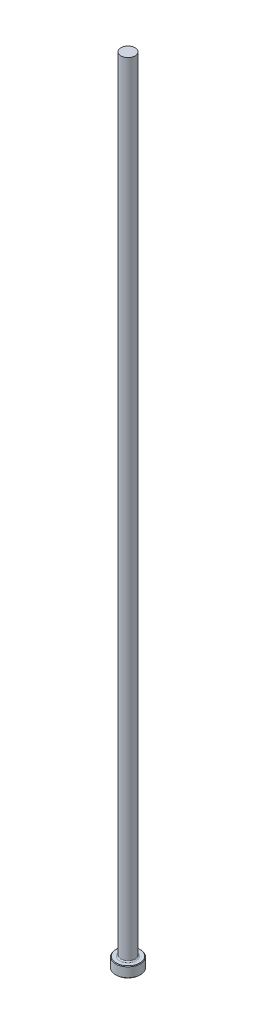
ISO-10303-21;
HEADER;
FILE_DESCRIPTION(('STEP AP214'),'2;1');
FILE_NAME('part.step','',(''),(''),'','','');
FILE_SCHEMA(('AUTOMOTIVE_DESIGN { 1 0 10303 214 1 1 1 1 }'));
ENDSEC;
DATA;
#1=APPLICATION_CONTEXT('core data for automotive mechanical design processes');
#2=APPLICATION_PROTOCOL_DEFINITION('international standard','automotive_design',2000,#1);
#3=PRODUCT_CONTEXT('',#1,'mechanical');
#4=PRODUCT('Part','Part','',(#3));
#5=PRODUCT_RELATED_PRODUCT_CATEGORY('part','',(#4));
#6=PRODUCT_DEFINITION_FORMATION('','',#4);
#7=PRODUCT_DEFINITION_CONTEXT('part definition',#1,'design');
#8=PRODUCT_DEFINITION('design','',#6,#7);
#9=PRODUCT_DEFINITION_SHAPE('','',#8);
#10=(LENGTH_UNIT() NAMED_UNIT(*) SI_UNIT(.MILLI.,.METRE.));
#11=(NAMED_UNIT(*) PLANE_ANGLE_UNIT() SI_UNIT($,.RADIAN.));
#12=(NAMED_UNIT(*) SI_UNIT($,.STERADIAN.) SOLID_ANGLE_UNIT());
#13=UNCERTAINTY_MEASURE_WITH_UNIT(LENGTH_MEASURE(1.E-05),#10,'distance_accuracy_value','');
#14=(GEOMETRIC_REPRESENTATION_CONTEXT(3) GLOBAL_UNCERTAINTY_ASSIGNED_CONTEXT((#13)) GLOBAL_UNIT_ASSIGNED_CONTEXT((#10,
#11,#12)) REPRESENTATION_CONTEXT('',''));
#15=CARTESIAN_POINT('',(0.,0.,0.));
#16=DIRECTION('',(0.,0.,1.));
#17=DIRECTION('',(1.,0.,0.));
#18=AXIS2_PLACEMENT_3D('',#15,#16,#17);
#19=CARTESIAN_POINT('',(0.,0.,0.));
#20=DIRECTION('',(0.,-1.,0.));
#21=DIRECTION('',(0.,0.,-1.));
#22=AXIS2_PLACEMENT_3D('',#19,#20,#21);
#23=PLANE('',#22);
#24=CARTESIAN_POINT('',(0.,0.,0.));
#25=DIRECTION('',(0.,-1.,0.));
#26=DIRECTION('',(0.,0.,-1.));
#27=AXIS2_PLACEMENT_3D('',#24,#25,#26);
#28=CIRCLE('',#27,5.29589999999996);
#29=CARTESIAN_POINT('',(0.,0.,-5.29589999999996));
#30=VERTEX_POINT('',#29);
#31=EDGE_CURVE('E46',#30,#30,#28,.T.);
#32=ORIENTED_EDGE('',*,*,#31,.T.);
#33=EDGE_LOOP('',(#32));
#34=FACE_BOUND('',#33,.T.);
#35=ADVANCED_FACE('F35',(#34),#23,.T.);
#36=CARTESIAN_POINT('',(0.,259.958771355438,0.));
#37=DIRECTION('',(0.,1.,0.));
#38=DIRECTION('',(0.,0.,1.));
#39=AXIS2_PLACEMENT_3D('',#36,#37,#38);
#40=CYLINDRICAL_SURFACE('',#39,5.54989999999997);
#41=CARTESIAN_POINT('',(0.,4.49579999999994,0.));
#42=DIRECTION('',(0.,1.,0.));
#43=DIRECTION('',(0.,0.,1.));
#44=AXIS2_PLACEMENT_3D('',#41,#42,#43);
#45=CIRCLE('',#44,5.54989999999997);
#46=CARTESIAN_POINT('',(0.,4.49579999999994,5.54989999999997));
#47=VERTEX_POINT('',#46);
#48=EDGE_CURVE('E50',#47,#47,#45,.F.);
#49=ORIENTED_EDGE('',*,*,#48,.T.);
#50=EDGE_LOOP('',(#49));
#51=FACE_BOUND('',#50,.T.);
#52=CARTESIAN_POINT('',(0.,0.254000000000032,0.));
#53=DIRECTION('',(0.,-1.,0.));
#54=DIRECTION('',(0.,0.,-1.));
#55=AXIS2_PLACEMENT_3D('',#52,#53,#54);
#56=CIRCLE('',#55,5.54989999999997);
#57=CARTESIAN_POINT('',(0.,0.254000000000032,-5.54989999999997));
#58=VERTEX_POINT('',#57);
#59=EDGE_CURVE('E55',#58,#58,#56,.F.);
#60=ORIENTED_EDGE('',*,*,#59,.T.);
#61=EDGE_LOOP('',(#60));
#62=FACE_BOUND('',#61,.T.);
#63=ADVANCED_FACE('F77',(#51,#62),#40,.T.);
#64=CARTESIAN_POINT('',(-5.54989999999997,4.7498,0.));
#65=DIRECTION('',(0.,1.,0.));
#66=DIRECTION('',(0.,0.,1.));
#67=AXIS2_PLACEMENT_3D('',#64,#65,#66);
#68=PLANE('',#67);
#69=CARTESIAN_POINT('',(0.,4.7498,0.));
#70=DIRECTION('',(0.,1.,0.));
#71=DIRECTION('',(0.,0.,1.));
#72=AXIS2_PLACEMENT_3D('',#69,#70,#71);
#73=CIRCLE('',#72,3.68299999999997);
#74=CARTESIAN_POINT('',(0.,4.7498,3.68299999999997));
#75=VERTEX_POINT('',#74);
#76=EDGE_CURVE('E10',#75,#75,#73,.F.);
#77=ORIENTED_EDGE('',*,*,#76,.T.);
#78=EDGE_LOOP('',(#77));
#79=FACE_BOUND('',#78,.T.);
#80=CARTESIAN_POINT('',(0.,4.7498,0.));
#81=DIRECTION('',(0.,1.,0.));
#82=DIRECTION('',(0.,0.,1.));
#83=AXIS2_PLACEMENT_3D('',#80,#81,#82);
#84=CIRCLE('',#83,5.29589999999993);
#85=CARTESIAN_POINT('',(0.,4.7498,5.29589999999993));
#86=VERTEX_POINT('',#85);
#87=EDGE_CURVE('E58',#86,#86,#84,.T.);
#88=ORIENTED_EDGE('',*,*,#87,.T.);
#89=EDGE_LOOP('',(#88));
#90=FACE_BOUND('',#89,.T.);
#91=ADVANCED_FACE('F69',(#79,#90),#68,.T.);
#92=CARTESIAN_POINT('',(0.,259.958771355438,0.));
#93=DIRECTION('',(0.,1.,0.));
#94=DIRECTION('',(0.,0.,1.));
#95=AXIS2_PLACEMENT_3D('',#92,#93,#94);
#96=CYLINDRICAL_SURFACE('',#95,3.17499999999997);
#97=CARTESIAN_POINT('',(0.,5.25779999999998,0.));
#98=DIRECTION('',(0.,1.,0.));
#99=DIRECTION('',(0.,0.,1.));
#100=AXIS2_PLACEMENT_3D('',#97,#98,#99);
#101=CIRCLE('',#100,3.17499999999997);
#102=CARTESIAN_POINT('',(0.,5.25779999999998,3.17499999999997));
#103=VERTEX_POINT('',#102);
#104=EDGE_CURVE('E42',#103,#103,#101,.T.);
#105=ORIENTED_EDGE('',*,*,#104,.T.);
#106=EDGE_LOOP('',(#105));
#107=FACE_BOUND('',#106,.T.);
#108=CARTESIAN_POINT('',(0.,355.6,0.));
#109=DIRECTION('',(0.,1.,0.));
#110=DIRECTION('',(0.,0.,1.));
#111=AXIS2_PLACEMENT_3D('',#108,#109,#110);
#112=CIRCLE('',#111,3.17499999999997);
#113=CARTESIAN_POINT('',(0.,355.6,3.17499999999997));
#114=VERTEX_POINT('',#113);
#115=EDGE_CURVE('E61',#114,#114,#112,.T.);
#116=ORIENTED_EDGE('',*,*,#115,.F.);
#117=EDGE_LOOP('',(#116));
#118=FACE_BOUND('',#117,.T.);
#119=ADVANCED_FACE('F67',(#107,#118),#96,.T.);
#120=CARTESIAN_POINT('',(-3.17499999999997,355.6,0.));
#121=DIRECTION('',(0.,1.,0.));
#122=DIRECTION('',(0.,0.,1.));
#123=AXIS2_PLACEMENT_3D('',#120,#121,#122);
#124=PLANE('',#123);
#125=ORIENTED_EDGE('',*,*,#115,.T.);
#126=EDGE_LOOP('',(#125));
#127=FACE_BOUND('',#126,.T.);
#128=ADVANCED_FACE('F65',(#127),#124,.T.);
#129=CARTESIAN_POINT('',(0.,4.74980000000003,0.));
#130=DIRECTION('',(0.,-1.,0.));
#131=DIRECTION('',(0.,0.,-1.));
#132=AXIS2_PLACEMENT_3D('',#129,#130,#131);
#133=CONICAL_SURFACE('',#132,5.29589999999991,0.785398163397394);
#134=ORIENTED_EDGE('',*,*,#48,.F.);
#135=EDGE_LOOP('',(#134));
#136=FACE_BOUND('',#135,.T.);
#137=ORIENTED_EDGE('',*,*,#87,.F.);
#138=EDGE_LOOP('',(#137));
#139=FACE_BOUND('',#138,.T.);
#140=ADVANCED_FACE('F75',(#136,#139),#133,.T.);
#141=CARTESIAN_POINT('',(0.,0.254000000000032,0.));
#142=DIRECTION('',(0.,1.,0.));
#143=DIRECTION('',(0.,0.,1.));
#144=AXIS2_PLACEMENT_3D('',#141,#142,#143);
#145=CONICAL_SURFACE('',#144,5.54989999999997,0.785398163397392);
#146=ORIENTED_EDGE('',*,*,#31,.F.);
#147=EDGE_LOOP('',(#146));
#148=FACE_BOUND('',#147,.T.);
#149=ORIENTED_EDGE('',*,*,#59,.F.);
#150=EDGE_LOOP('',(#149));
#151=FACE_BOUND('',#150,.T.);
#152=ADVANCED_FACE('F89',(#148,#151),#145,.T.);
#153=CARTESIAN_POINT('',(0.,5.25779999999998,0.));
#154=DIRECTION('',(0.,1.,0.));
#155=DIRECTION('',(0.,0.,1.));
#156=AXIS2_PLACEMENT_3D('',#153,#154,#155);
#157=TOROIDAL_SURFACE('',#156,3.68299999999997,0.508);
#158=ORIENTED_EDGE('',*,*,#76,.F.);
#159=EDGE_LOOP('',(#158));
#160=FACE_BOUND('',#159,.T.);
#161=ORIENTED_EDGE('',*,*,#104,.F.);
#162=EDGE_LOOP('',(#161));
#163=FACE_BOUND('',#162,.T.);
#164=ADVANCED_FACE('F37',(#160,#163),#157,.F.);
#165=CLOSED_SHELL('',(#35,#63,#91,#119,#128,#140,#152,#164));
#166=MANIFOLD_SOLID_BREP('B2',#165);
#167=ADVANCED_BREP_SHAPE_REPRESENTATION('',(#18,#166),#14);
#168=SHAPE_DEFINITION_REPRESENTATION(#9,#167);
ENDSEC;
END-ISO-10303-21;
